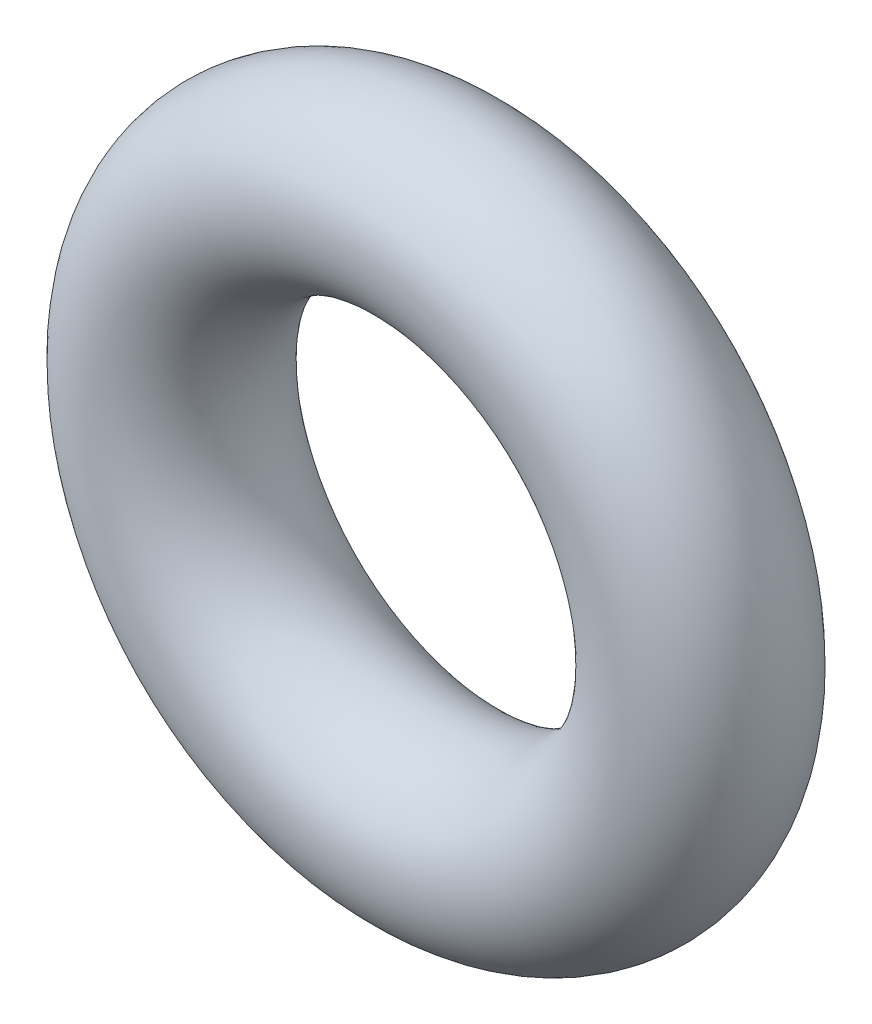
ISO-10303-21;
HEADER;
FILE_DESCRIPTION(('STEP AP214'),'2;1');
FILE_NAME('part.step','',(''),(''),'','','');
FILE_SCHEMA(('AUTOMOTIVE_DESIGN { 1 0 10303 214 1 1 1 1 }'));
ENDSEC;
DATA;
#1=APPLICATION_CONTEXT('core data for automotive mechanical design processes');
#2=APPLICATION_PROTOCOL_DEFINITION('international standard','automotive_design',2000,#1);
#3=PRODUCT_CONTEXT('',#1,'mechanical');
#4=PRODUCT('Part','Part','',(#3));
#5=PRODUCT_RELATED_PRODUCT_CATEGORY('part','',(#4));
#6=PRODUCT_DEFINITION_FORMATION('','',#4);
#7=PRODUCT_DEFINITION_CONTEXT('part definition',#1,'design');
#8=PRODUCT_DEFINITION('design','',#6,#7);
#9=PRODUCT_DEFINITION_SHAPE('','',#8);
#10=(LENGTH_UNIT() NAMED_UNIT(*) SI_UNIT(.MILLI.,.METRE.));
#11=(NAMED_UNIT(*) PLANE_ANGLE_UNIT() SI_UNIT($,.RADIAN.));
#12=(NAMED_UNIT(*) SI_UNIT($,.STERADIAN.) SOLID_ANGLE_UNIT());
#13=UNCERTAINTY_MEASURE_WITH_UNIT(LENGTH_MEASURE(1.E-05),#10,'distance_accuracy_value','');
#14=(GEOMETRIC_REPRESENTATION_CONTEXT(3) GLOBAL_UNCERTAINTY_ASSIGNED_CONTEXT((#13)) GLOBAL_UNIT_ASSIGNED_CONTEXT((#10,
#11,#12)) REPRESENTATION_CONTEXT('',''));
#15=CARTESIAN_POINT('',(0.,0.,0.));
#16=DIRECTION('',(0.,0.,1.));
#17=DIRECTION('',(1.,0.,0.));
#18=AXIS2_PLACEMENT_3D('',#15,#16,#17);
#19=CARTESIAN_POINT('',(0.,0.,0.));
#20=DIRECTION('',(0.,0.,-1.));
#21=DIRECTION('',(-1.,0.,0.));
#22=AXIS2_PLACEMENT_3D('',#19,#20,#21);
#23=TOROIDAL_SURFACE('',#22,30.,10.);
#24=CARTESIAN_POINT('',(-40.,0.,0.));
#25=VERTEX_POINT('',#24);
#26=VERTEX_LOOP('',#25);
#27=FACE_BOUND('',#26,.T.);
#28=ADVANCED_FACE('F27',(#27),#23,.T.);
#29=CLOSED_SHELL('',(#28));
#30=MANIFOLD_SOLID_BREP('B2',#29);
#31=ADVANCED_BREP_SHAPE_REPRESENTATION('',(#18,#30),#14);
#32=SHAPE_DEFINITION_REPRESENTATION(#9,#31);
ENDSEC;
END-ISO-10303-21;
